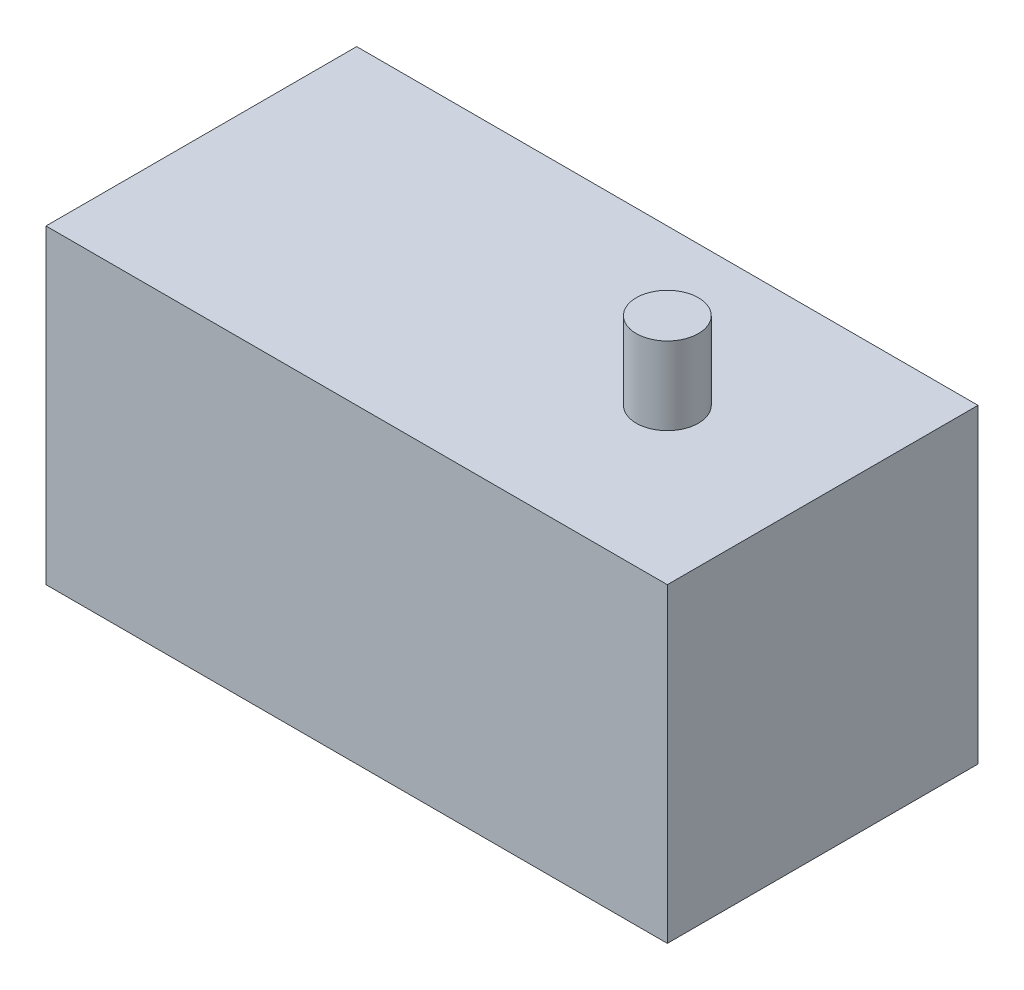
ISO-10303-21;
HEADER;
FILE_DESCRIPTION(('STEP AP214'),'2;1');
FILE_NAME('part.step','',(''),(''),'','','');
FILE_SCHEMA(('AUTOMOTIVE_DESIGN { 1 0 10303 214 1 1 1 1 }'));
ENDSEC;
DATA;
#1=APPLICATION_CONTEXT('core data for automotive mechanical design processes');
#2=APPLICATION_PROTOCOL_DEFINITION('international standard','automotive_design',2000,#1);
#3=PRODUCT_CONTEXT('',#1,'mechanical');
#4=PRODUCT('Part','Part','',(#3));
#5=PRODUCT_RELATED_PRODUCT_CATEGORY('part','',(#4));
#6=PRODUCT_DEFINITION_FORMATION('','',#4);
#7=PRODUCT_DEFINITION_CONTEXT('part definition',#1,'design');
#8=PRODUCT_DEFINITION('design','',#6,#7);
#9=PRODUCT_DEFINITION_SHAPE('','',#8);
#10=(LENGTH_UNIT() NAMED_UNIT(*) SI_UNIT(.MILLI.,.METRE.));
#11=(NAMED_UNIT(*) PLANE_ANGLE_UNIT() SI_UNIT($,.RADIAN.));
#12=(NAMED_UNIT(*) SI_UNIT($,.STERADIAN.) SOLID_ANGLE_UNIT());
#13=UNCERTAINTY_MEASURE_WITH_UNIT(LENGTH_MEASURE(1.E-05),#10,'distance_accuracy_value','');
#14=(GEOMETRIC_REPRESENTATION_CONTEXT(3) GLOBAL_UNCERTAINTY_ASSIGNED_CONTEXT((#13)) GLOBAL_UNIT_ASSIGNED_CONTEXT((#10,
#11,#12)) REPRESENTATION_CONTEXT('',''));
#15=CARTESIAN_POINT('',(0.,0.,0.));
#16=DIRECTION('',(0.,0.,1.));
#17=DIRECTION('',(1.,0.,0.));
#18=AXIS2_PLACEMENT_3D('',#15,#16,#17);
#19=CARTESIAN_POINT('',(-20.,20.,10.));
#20=DIRECTION('',(0.,0.,-1.));
#21=DIRECTION('',(-1.,0.,0.));
#22=AXIS2_PLACEMENT_3D('',#19,#20,#21);
#23=PLANE('',#22);
#24=DIRECTION('',(1.,0.,0.));
#25=VECTOR('',#24,1.);
#26=CARTESIAN_POINT('',(-20.,0.,10.));
#27=LINE('',#26,#25);
#28=CARTESIAN_POINT('',(-20.,0.,10.));
#29=VERTEX_POINT('',#28);
#30=CARTESIAN_POINT('',(20.,0.,10.));
#31=VERTEX_POINT('',#30);
#32=EDGE_CURVE('E151',#29,#31,#27,.T.);
#33=ORIENTED_EDGE('',*,*,#32,.T.);
#34=DIRECTION('',(0.,-1.,0.));
#35=VECTOR('',#34,1.);
#36=CARTESIAN_POINT('',(20.,20.,10.));
#37=LINE('',#36,#35);
#38=CARTESIAN_POINT('',(20.,20.,10.));
#39=VERTEX_POINT('',#38);
#40=EDGE_CURVE('E11',#39,#31,#37,.T.);
#41=ORIENTED_EDGE('',*,*,#40,.F.);
#42=DIRECTION('',(1.,0.,0.));
#43=VECTOR('',#42,1.);
#44=CARTESIAN_POINT('',(-20.,20.,10.));
#45=LINE('',#44,#43);
#46=CARTESIAN_POINT('',(-20.,20.,10.));
#47=VERTEX_POINT('',#46);
#48=EDGE_CURVE('E154',#47,#39,#45,.T.);
#49=ORIENTED_EDGE('',*,*,#48,.F.);
#50=DIRECTION('',(0.,-1.,0.));
#51=VECTOR('',#50,1.);
#52=CARTESIAN_POINT('',(-20.,20.,10.));
#53=LINE('',#52,#51);
#54=EDGE_CURVE('E60',#47,#29,#53,.T.);
#55=ORIENTED_EDGE('',*,*,#54,.T.);
#56=EDGE_LOOP('',(#33,#41,#49,#55));
#57=FACE_BOUND('',#56,.T.);
#58=ADVANCED_FACE('F37',(#57),#23,.F.);
#59=CARTESIAN_POINT('',(20.,20.,10.));
#60=DIRECTION('',(-1.,0.,0.));
#61=DIRECTION('',(0.,0.,1.));
#62=AXIS2_PLACEMENT_3D('',#59,#60,#61);
#63=PLANE('',#62);
#64=DIRECTION('',(0.,0.,-1.));
#65=VECTOR('',#64,1.);
#66=CARTESIAN_POINT('',(20.,0.,10.));
#67=LINE('',#66,#65);
#68=CARTESIAN_POINT('',(20.,0.,-10.));
#69=VERTEX_POINT('',#68);
#70=EDGE_CURVE('E164',#31,#69,#67,.T.);
#71=ORIENTED_EDGE('',*,*,#70,.T.);
#72=DIRECTION('',(0.,-1.,0.));
#73=VECTOR('',#72,1.);
#74=CARTESIAN_POINT('',(20.,20.,-10.));
#75=LINE('',#74,#73);
#76=CARTESIAN_POINT('',(20.,20.,-10.));
#77=VERTEX_POINT('',#76);
#78=EDGE_CURVE('E44',#77,#69,#75,.T.);
#79=ORIENTED_EDGE('',*,*,#78,.F.);
#80=DIRECTION('',(0.,0.,-1.));
#81=VECTOR('',#80,1.);
#82=CARTESIAN_POINT('',(20.,20.,10.));
#83=LINE('',#82,#81);
#84=EDGE_CURVE('E86',#39,#77,#83,.T.);
#85=ORIENTED_EDGE('',*,*,#84,.F.);
#86=ORIENTED_EDGE('',*,*,#40,.T.);
#87=EDGE_LOOP('',(#71,#79,#85,#86));
#88=FACE_BOUND('',#87,.T.);
#89=ADVANCED_FACE('F178',(#88),#63,.F.);
#90=CARTESIAN_POINT('',(-20.,20.,-10.));
#91=DIRECTION('',(0.,0.,-1.));
#92=DIRECTION('',(-1.,0.,0.));
#93=AXIS2_PLACEMENT_3D('',#90,#91,#92);
#94=PLANE('',#93);
#95=DIRECTION('',(1.,0.,0.));
#96=VECTOR('',#95,1.);
#97=CARTESIAN_POINT('',(-20.,0.,-10.));
#98=LINE('',#97,#96);
#99=CARTESIAN_POINT('',(-20.,0.,-10.));
#100=VERTEX_POINT('',#99);
#101=EDGE_CURVE('E167',#100,#69,#98,.T.);
#102=ORIENTED_EDGE('',*,*,#101,.F.);
#103=DIRECTION('',(0.,-1.,0.));
#104=VECTOR('',#103,1.);
#105=CARTESIAN_POINT('',(-20.,20.,-10.));
#106=LINE('',#105,#104);
#107=CARTESIAN_POINT('',(-20.,20.,-10.));
#108=VERTEX_POINT('',#107);
#109=EDGE_CURVE('E173',#108,#100,#106,.T.);
#110=ORIENTED_EDGE('',*,*,#109,.F.);
#111=DIRECTION('',(1.,0.,0.));
#112=VECTOR('',#111,1.);
#113=CARTESIAN_POINT('',(-20.,20.,-10.));
#114=LINE('',#113,#112);
#115=EDGE_CURVE('E158',#108,#77,#114,.T.);
#116=ORIENTED_EDGE('',*,*,#115,.T.);
#117=ORIENTED_EDGE('',*,*,#78,.T.);
#118=EDGE_LOOP('',(#102,#110,#116,#117));
#119=FACE_BOUND('',#118,.T.);
#120=ADVANCED_FACE('F176',(#119),#94,.T.);
#121=CARTESIAN_POINT('',(-20.,20.,10.));
#122=DIRECTION('',(-1.,0.,0.));
#123=DIRECTION('',(0.,0.,1.));
#124=AXIS2_PLACEMENT_3D('',#121,#122,#123);
#125=PLANE('',#124);
#126=DIRECTION('',(0.,1.,0.));
#127=VECTOR('',#126,1.);
#128=CARTESIAN_POINT('',(-20.,5.75,2.23274995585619));
#129=LINE('',#128,#127);
#130=CARTESIAN_POINT('',(-20.,4.25,2.23274995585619));
#131=VERTEX_POINT('',#130);
#132=CARTESIAN_POINT('',(-20.,5.75,2.23274995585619));
#133=VERTEX_POINT('',#132);
#134=EDGE_CURVE('E51',#131,#133,#129,.T.);
#135=ORIENTED_EDGE('',*,*,#134,.F.);
#136=DIRECTION('',(0.,0.,1.));
#137=VECTOR('',#136,1.);
#138=CARTESIAN_POINT('',(-20.,4.25,-2.76725004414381));
#139=LINE('',#138,#137);
#140=CARTESIAN_POINT('',(-20.,4.25,-2.76725004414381));
#141=VERTEX_POINT('',#140);
#142=EDGE_CURVE('E129',#141,#131,#139,.T.);
#143=ORIENTED_EDGE('',*,*,#142,.F.);
#144=DIRECTION('',(0.,-1.,0.));
#145=VECTOR('',#144,1.);
#146=CARTESIAN_POINT('',(-20.,5.75,-2.76725004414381));
#147=LINE('',#146,#145);
#148=CARTESIAN_POINT('',(-20.,5.75,-2.76725004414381));
#149=VERTEX_POINT('',#148);
#150=EDGE_CURVE('E132',#149,#141,#147,.T.);
#151=ORIENTED_EDGE('',*,*,#150,.F.);
#152=DIRECTION('',(0.,0.,-1.));
#153=VECTOR('',#152,1.);
#154=CARTESIAN_POINT('',(-20.,5.75,-2.76725004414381));
#155=LINE('',#154,#153);
#156=EDGE_CURVE('E138',#133,#149,#155,.T.);
#157=ORIENTED_EDGE('',*,*,#156,.F.);
#158=EDGE_LOOP('',(#135,#143,#151,#157));
#159=FACE_BOUND('',#158,.T.);
#160=DIRECTION('',(0.,0.,-1.));
#161=VECTOR('',#160,1.);
#162=CARTESIAN_POINT('',(-20.,0.,10.));
#163=LINE('',#162,#161);
#164=EDGE_CURVE('E156',#29,#100,#163,.T.);
#165=ORIENTED_EDGE('',*,*,#164,.F.);
#166=ORIENTED_EDGE('',*,*,#54,.F.);
#167=DIRECTION('',(0.,0.,-1.));
#168=VECTOR('',#167,1.);
#169=CARTESIAN_POINT('',(-20.,20.,10.));
#170=LINE('',#169,#168);
#171=EDGE_CURVE('E161',#47,#108,#170,.T.);
#172=ORIENTED_EDGE('',*,*,#171,.T.);
#173=ORIENTED_EDGE('',*,*,#109,.T.);
#174=EDGE_LOOP('',(#165,#166,#172,#173));
#175=FACE_BOUND('',#174,.T.);
#176=ADVANCED_FACE('F182',(#159,#175),#125,.T.);
#177=CARTESIAN_POINT('',(0.,20.,0.));
#178=DIRECTION('',(0.,1.,0.));
#179=DIRECTION('',(0.,0.,1.));
#180=AXIS2_PLACEMENT_3D('',#177,#178,#179);
#181=PLANE('',#180);
#182=CARTESIAN_POINT('',(9.99999999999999,20.,0.));
#183=DIRECTION('',(0.,1.,0.));
#184=DIRECTION('',(0.,0.,1.));
#185=AXIS2_PLACEMENT_3D('',#182,#183,#184);
#186=CIRCLE('',#185,2.);
#187=CARTESIAN_POINT('',(9.99999999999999,20.,2.));
#188=VERTEX_POINT('',#187);
#189=EDGE_CURVE('E144',#188,#188,#186,.T.);
#190=ORIENTED_EDGE('',*,*,#189,.F.);
#191=EDGE_LOOP('',(#190));
#192=FACE_BOUND('',#191,.T.);
#193=ORIENTED_EDGE('',*,*,#48,.T.);
#194=ORIENTED_EDGE('',*,*,#84,.T.);
#195=ORIENTED_EDGE('',*,*,#115,.F.);
#196=ORIENTED_EDGE('',*,*,#171,.F.);
#197=EDGE_LOOP('',(#193,#194,#195,#196));
#198=FACE_BOUND('',#197,.T.);
#199=ADVANCED_FACE('F185',(#192,#198),#181,.T.);
#200=CARTESIAN_POINT('',(0.,0.,0.));
#201=DIRECTION('',(0.,1.,0.));
#202=DIRECTION('',(0.,0.,1.));
#203=AXIS2_PLACEMENT_3D('',#200,#201,#202);
#204=PLANE('',#203);
#205=ORIENTED_EDGE('',*,*,#32,.F.);
#206=ORIENTED_EDGE('',*,*,#164,.T.);
#207=ORIENTED_EDGE('',*,*,#101,.T.);
#208=ORIENTED_EDGE('',*,*,#70,.F.);
#209=EDGE_LOOP('',(#205,#206,#207,#208));
#210=FACE_BOUND('',#209,.T.);
#211=ADVANCED_FACE('F181',(#210),#204,.F.);
#212=CARTESIAN_POINT('',(9.99999999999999,25.,0.));
#213=DIRECTION('',(0.,-1.,0.));
#214=DIRECTION('',(0.,0.,-1.));
#215=AXIS2_PLACEMENT_3D('',#212,#213,#214);
#216=CYLINDRICAL_SURFACE('',#215,2.);
#217=CARTESIAN_POINT('',(9.99999999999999,25.,0.));
#218=DIRECTION('',(0.,1.,0.));
#219=DIRECTION('',(0.,0.,1.));
#220=AXIS2_PLACEMENT_3D('',#217,#218,#219);
#221=CIRCLE('',#220,2.);
#222=CARTESIAN_POINT('',(9.99999999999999,25.,2.));
#223=VERTEX_POINT('',#222);
#224=EDGE_CURVE('E148',#223,#223,#221,.T.);
#225=ORIENTED_EDGE('',*,*,#224,.F.);
#226=EDGE_LOOP('',(#225));
#227=FACE_BOUND('',#226,.T.);
#228=ORIENTED_EDGE('',*,*,#189,.T.);
#229=EDGE_LOOP('',(#228));
#230=FACE_BOUND('',#229,.T.);
#231=ADVANCED_FACE('F200',(#227,#230),#216,.T.);
#232=CARTESIAN_POINT('',(9.99999999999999,25.,0.));
#233=DIRECTION('',(0.,1.,0.));
#234=DIRECTION('',(0.,0.,1.));
#235=AXIS2_PLACEMENT_3D('',#232,#233,#234);
#236=PLANE('',#235);
#237=ORIENTED_EDGE('',*,*,#224,.T.);
#238=EDGE_LOOP('',(#237));
#239=FACE_BOUND('',#238,.T.);
#240=ADVANCED_FACE('F206',(#239),#236,.T.);
#241=CARTESIAN_POINT('',(-15.,5.75,2.23274995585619));
#242=DIRECTION('',(0.,0.,1.));
#243=DIRECTION('',(0.,-1.,0.));
#244=AXIS2_PLACEMENT_3D('',#241,#242,#243);
#245=PLANE('',#244);
#246=ORIENTED_EDGE('',*,*,#134,.T.);
#247=DIRECTION('',(-1.,0.,0.));
#248=VECTOR('',#247,1.);
#249=CARTESIAN_POINT('',(-15.,5.75,2.23274995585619));
#250=LINE('',#249,#248);
#251=CARTESIAN_POINT('',(-15.,5.75,2.23274995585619));
#252=VERTEX_POINT('',#251);
#253=EDGE_CURVE('E107',#252,#133,#250,.T.);
#254=ORIENTED_EDGE('',*,*,#253,.F.);
#255=DIRECTION('',(0.,1.,0.));
#256=VECTOR('',#255,1.);
#257=CARTESIAN_POINT('',(-15.,5.75,2.23274995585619));
#258=LINE('',#257,#256);
#259=CARTESIAN_POINT('',(-15.,4.25,2.23274995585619));
#260=VERTEX_POINT('',#259);
#261=EDGE_CURVE('E111',#260,#252,#258,.T.);
#262=ORIENTED_EDGE('',*,*,#261,.F.);
#263=DIRECTION('',(-1.,0.,0.));
#264=VECTOR('',#263,1.);
#265=CARTESIAN_POINT('',(-15.,4.25,2.23274995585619));
#266=LINE('',#265,#264);
#267=EDGE_CURVE('E142',#260,#131,#266,.T.);
#268=ORIENTED_EDGE('',*,*,#267,.T.);
#269=EDGE_LOOP('',(#246,#254,#262,#268));
#270=FACE_BOUND('',#269,.T.);
#271=ADVANCED_FACE('F109',(#270),#245,.F.);
#272=CARTESIAN_POINT('',(-15.,4.25,-2.76725004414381));
#273=DIRECTION('',(0.,-1.,0.));
#274=DIRECTION('',(0.,0.,-1.));
#275=AXIS2_PLACEMENT_3D('',#272,#273,#274);
#276=PLANE('',#275);
#277=ORIENTED_EDGE('',*,*,#142,.T.);
#278=ORIENTED_EDGE('',*,*,#267,.F.);
#279=DIRECTION('',(0.,0.,1.));
#280=VECTOR('',#279,1.);
#281=CARTESIAN_POINT('',(-15.,4.25,-2.76725004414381));
#282=LINE('',#281,#280);
#283=CARTESIAN_POINT('',(-15.,4.25,-2.76725004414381));
#284=VERTEX_POINT('',#283);
#285=EDGE_CURVE('E117',#284,#260,#282,.T.);
#286=ORIENTED_EDGE('',*,*,#285,.F.);
#287=DIRECTION('',(-1.,0.,0.));
#288=VECTOR('',#287,1.);
#289=CARTESIAN_POINT('',(-15.,4.25,-2.76725004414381));
#290=LINE('',#289,#288);
#291=EDGE_CURVE('E145',#284,#141,#290,.T.);
#292=ORIENTED_EDGE('',*,*,#291,.T.);
#293=EDGE_LOOP('',(#277,#278,#286,#292));
#294=FACE_BOUND('',#293,.T.);
#295=ADVANCED_FACE('F213',(#294),#276,.F.);
#296=CARTESIAN_POINT('',(-15.,5.75,-2.76725004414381));
#297=DIRECTION('',(0.,0.,-1.));
#298=DIRECTION('',(0.,1.,0.));
#299=AXIS2_PLACEMENT_3D('',#296,#297,#298);
#300=PLANE('',#299);
#301=ORIENTED_EDGE('',*,*,#150,.T.);
#302=ORIENTED_EDGE('',*,*,#291,.F.);
#303=DIRECTION('',(0.,-1.,0.));
#304=VECTOR('',#303,1.);
#305=CARTESIAN_POINT('',(-15.,5.75,-2.76725004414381));
#306=LINE('',#305,#304);
#307=CARTESIAN_POINT('',(-15.,5.75,-2.76725004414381));
#308=VERTEX_POINT('',#307);
#309=EDGE_CURVE('E125',#308,#284,#306,.T.);
#310=ORIENTED_EDGE('',*,*,#309,.F.);
#311=DIRECTION('',(-1.,0.,0.));
#312=VECTOR('',#311,1.);
#313=CARTESIAN_POINT('',(-15.,5.75,-2.76725004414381));
#314=LINE('',#313,#312);
#315=EDGE_CURVE('E116',#308,#149,#314,.T.);
#316=ORIENTED_EDGE('',*,*,#315,.T.);
#317=EDGE_LOOP('',(#301,#302,#310,#316));
#318=FACE_BOUND('',#317,.T.);
#319=ADVANCED_FACE('F216',(#318),#300,.F.);
#320=CARTESIAN_POINT('',(-15.,5.75,-2.76725004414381));
#321=DIRECTION('',(0.,1.,0.));
#322=DIRECTION('',(0.,0.,1.));
#323=AXIS2_PLACEMENT_3D('',#320,#321,#322);
#324=PLANE('',#323);
#325=ORIENTED_EDGE('',*,*,#156,.T.);
#326=ORIENTED_EDGE('',*,*,#315,.F.);
#327=DIRECTION('',(0.,0.,-1.));
#328=VECTOR('',#327,1.);
#329=CARTESIAN_POINT('',(-15.,5.75,-2.76725004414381));
#330=LINE('',#329,#328);
#331=EDGE_CURVE('E120',#252,#308,#330,.T.);
#332=ORIENTED_EDGE('',*,*,#331,.F.);
#333=ORIENTED_EDGE('',*,*,#253,.T.);
#334=EDGE_LOOP('',(#325,#326,#332,#333));
#335=FACE_BOUND('',#334,.T.);
#336=ADVANCED_FACE('F121',(#335),#324,.F.);
#337=CARTESIAN_POINT('',(-15.,0.,0.));
#338=DIRECTION('',(-1.,0.,0.));
#339=DIRECTION('',(0.,0.,1.));
#340=AXIS2_PLACEMENT_3D('',#337,#338,#339);
#341=PLANE('',#340);
#342=ORIENTED_EDGE('',*,*,#261,.T.);
#343=ORIENTED_EDGE('',*,*,#331,.T.);
#344=ORIENTED_EDGE('',*,*,#309,.T.);
#345=ORIENTED_EDGE('',*,*,#285,.T.);
#346=EDGE_LOOP('',(#342,#343,#344,#345));
#347=FACE_BOUND('',#346,.T.);
#348=ADVANCED_FACE('F127',(#347),#341,.T.);
#349=CLOSED_SHELL('',(#58,#89,#120,#176,#199,#211,#231,#240,#271,#295,#319,#336,#348));
#350=MANIFOLD_SOLID_BREP('B2',#349);
#351=ADVANCED_BREP_SHAPE_REPRESENTATION('',(#18,#350),#14);
#352=SHAPE_DEFINITION_REPRESENTATION(#9,#351);
ENDSEC;
END-ISO-10303-21;
